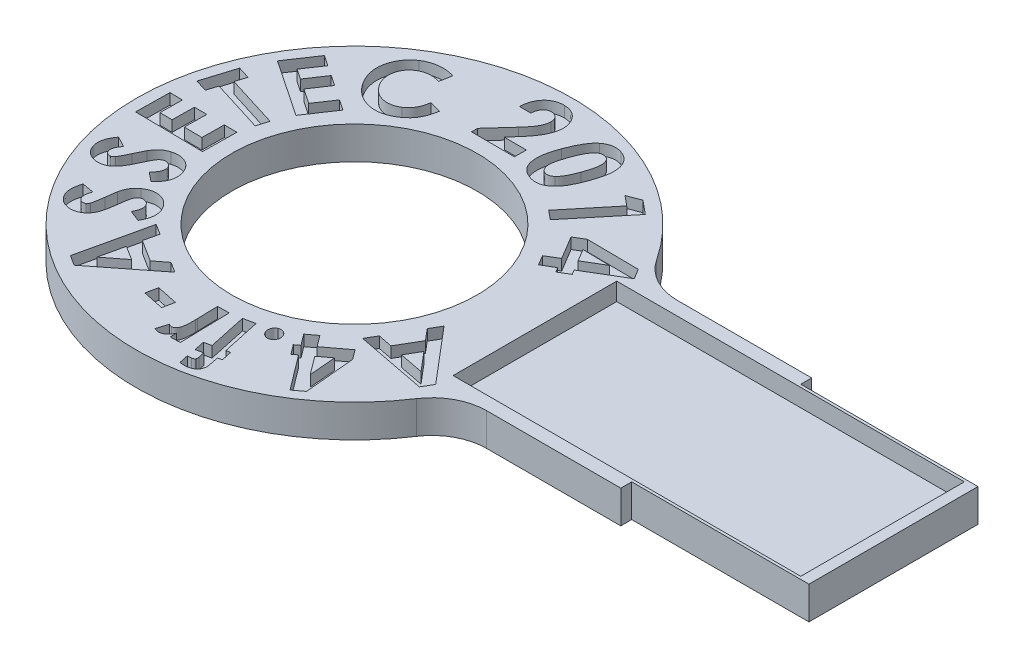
from build123d import *

# Parameters (mm, degrees)
BOSS_EXTRU_1_DEPTH      = 2.4
ESQUISSE2_W             = 25.5
ESQUISSE2_H             = 12
ENL_V_MAT_EXTRU_1_DEPTH = 1.3
ESQUISSE3_R             = 9
ENL_V_MAT_EXTRU_2_DEPTH = 35.559151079
ENL_V_MAT_EXTRU_3_DEPTH = 0.8
CONG_1_R                = 4


with BuildPart() as part:
    # Esquisse1 → Boss.-Extru.1 (new body)
    with BuildSketch(Plane(origin=(0, 0, 0), x_dir=(1, 0, 0), z_dir=(0, 1, 0))):
        with BuildLine():
            Line((25, 6.2), (25, -6.2))
            Line((25, -6.2), (12, -6.2))
            Line((12, -6.2), (12, -7))
            Line((12, -7), (-0.150595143, -7))
            ThreePointArc((-0.150595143, -7), (-30.538089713, 0), (-0.150595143, 7))
            Line((-0.150595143, 7), (12, 7))
            Line((12, 7), (12, 6.2))
            Line((12, 6.2), (25, 6.2))
        make_face()
    extrude(amount=-BOSS_EXTRU_1_DEPTH)

    # Esquisse2 → Enl_v. mat.-Extru.1 (cut)
    with BuildSketch(Plane(origin=(0, 0, 0), x_dir=(1, 0, 0), z_dir=(0, 1, 0))):
        with Locations((11.45, 0)):
            Rectangle(ESQUISSE2_W, ESQUISSE2_H)
    extrude(amount=-ENL_V_MAT_EXTRU_1_DEPTH, mode=Mode.SUBTRACT)

    # Esquisse3 → Enl_v. mat.-Extru.2 (cut, through all)
    with BuildSketch(Plane(origin=(0, 0, 0), x_dir=(1, 0, 0), z_dir=(0, 1, 0))):
        with Locations(Location((-14.538089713, 0, 0), (0, 0, 270))):
            Circle(ESQUISSE3_R)
    extrude(amount=-ENL_V_MAT_EXTRU_2_DEPTH, mode=Mode.SUBTRACT)

    # Esquisse4 → Enl_v. mat.-Extru.3 (cut)
    # profile 1 of 17: a face of its own
    with BuildSketch(Plane(origin=(0, 0, 0), x_dir=(1, 0, 0), z_dir=(0, 1, 0))):
        Polygon((-1.258038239, 7.539169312), (-0.812325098, 6.793977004), (-3.569736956, 5.143335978), (-3.360402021, 4.794778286), (-4.113607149, 4.344057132), (-4.322942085, 4.692614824), (-5.202349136, 4.165771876), (-5.638046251, 4.894938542), (-4.7586392, 5.421781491), (-5.781275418, 7.129513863), (-5.02807029, 7.580235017), align=None)
        Polygon((-4.005434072, 5.872502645), (-2.570137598, 6.731877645), (-4.541291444, 6.766933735), align=None, mode=Mode.SUBTRACT)
    # profile 2 of 17: a face of its own
    with BuildSketch(Plane(origin=(0, 0, 0), x_dir=(1, 0, 0), z_dir=(0, 1, 0))):
        Polygon((-5.48309813, 12.107136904), (-4.485501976, 11.283819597), (-7.634540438, 7.462705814), (-8.296599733, 8.008579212), (-5.710461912, 11.146600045), (-6.430614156, 11.740550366), align=None)
    # profile 3 of 17: a face of its own
    with BuildSketch(Plane(origin=(0, 0, 0), x_dir=(1, 0, 0), z_dir=(0, 1, 0))):
        with BuildLine():
            add(Edge.make_bspline(
                [(-9.332782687, 14.355199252), (-9.294450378, 14.340822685), (-9.219190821, 14.312596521), (-9.112270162, 14.259650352), (-9.012604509, 14.200468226), (-8.918044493, 14.136666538), (-8.832666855, 14.063982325), (-8.752490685, 13.986770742), (-8.680184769, 13.902166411), (-8.6151973, 13.810795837), (-8.556841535, 13.713543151), (-8.506375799, 13.609709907), (-8.46470415, 13.498865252), (-8.429160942, 13.381955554), (-8.403824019, 13.257773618), (-8.384548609, 13.127736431), (-8.37380702, 12.990884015), (-8.370760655, 12.846745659), (-8.376916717, 12.693876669), (-8.393348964, 12.531407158), (-8.419689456, 12.358246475), (-8.456768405, 12.174405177), (-8.505691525, 11.980331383), (-8.562587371, 11.775330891), (-8.63083112, 11.559881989), (-8.682947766, 11.413667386), (-8.709785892, 11.338372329)],
                knots=[0, 0, 0, 0, 0.84727759, 1.663498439, 2.46616903, 3.246621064, 4.022004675, 4.784648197, 5.54948188, 6.322581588, 7.103890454, 7.89540897, 8.709401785, 9.55365625, 10.422763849, 11.331021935, 12.274281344, 13.263080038, 14.314697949, 15.440078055, 16.642649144, 17.940132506, 19.321726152, 20.78602639, 22.34492369, 24, 24, 24, 24], degree=3))
            add(Edge.make_bspline(
                [(-8.709785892, 11.338372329), (-8.737760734, 11.26276494), (-8.792134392, 11.115809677), (-8.878073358, 10.904111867), (-8.966269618, 10.708332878), (-9.054243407, 10.526805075), (-9.144382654, 10.36086357), (-9.234711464, 10.208948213), (-9.32861573, 10.073715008), (-9.421667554, 9.951560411), (-9.516437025, 9.842901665), (-9.612128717, 9.744941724), (-9.709019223, 9.657274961), (-9.805918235, 9.578238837), (-9.904988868, 9.511248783), (-10.003676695, 9.452255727), (-10.104765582, 9.405537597), (-10.205782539, 9.366519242), (-10.309381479, 9.339646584), (-10.414921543, 9.321551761), (-10.522831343, 9.312412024), (-10.633140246, 9.313506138), (-10.745627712, 9.324976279), (-10.86071916, 9.345186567), (-10.978475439, 9.3738226), (-11.05606733, 9.400632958), (-11.095603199, 9.414293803)],
                knots=[0, 0, 0, 0, 1.676343, 3.258245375, 4.749863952, 6.140889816, 7.451855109, 8.675849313, 9.813977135, 10.873498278, 11.867533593, 12.810149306, 13.719423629, 14.583580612, 15.407769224, 16.204360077, 16.971482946, 17.720677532, 18.453216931, 19.192828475, 19.945232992, 20.702013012, 21.483330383, 22.29371864, 23.130588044, 24, 24, 24, 24], degree=3))
            add(Edge.make_bspline(
                [(-11.095603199, 9.414293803), (-11.134865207, 9.429500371), (-11.211732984, 9.45927203), (-11.321903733, 9.511497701), (-11.423585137, 9.570797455), (-11.518912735, 9.63458731), (-11.604703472, 9.706494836), (-11.684619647, 9.782318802), (-11.755834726, 9.865235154), (-11.820357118, 9.953342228), (-11.876629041, 10.048432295), (-11.925820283, 10.14950268), (-11.96663828, 10.257294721), (-12.000920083, 10.37105988), (-12.027588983, 10.491284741), (-12.047912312, 10.617669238), (-12.059360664, 10.750549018), (-12.064714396, 10.89062176), (-12.060814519, 11.039568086), (-12.044821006, 11.198649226), (-12.019912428, 11.368863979), (-11.983445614, 11.550297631), (-11.93584879, 11.742540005), (-11.878608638, 11.946364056), (-11.81060152, 12.161089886), (-11.75908361, 12.307064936), (-11.73262243, 12.382042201)],
                knots=[0, 0, 0, 0, 0.882603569, 1.727975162, 2.55281072, 3.348836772, 4.129479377, 4.89682755, 5.656087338, 6.41776336, 7.183673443, 7.969477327, 8.77157415, 9.59759695, 10.458589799, 11.351624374, 12.279426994, 13.253048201, 14.289417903, 15.400381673, 16.603170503, 17.894977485, 19.278648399, 20.754590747, 22.333058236, 24, 24, 24, 24], degree=3))
            add(Edge.make_bspline(
                [(-11.73262243, 12.382042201), (-11.694204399, 12.485929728), (-11.620092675, 12.686337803), (-11.497080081, 12.969977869), (-11.373089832, 13.22824521), (-11.243363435, 13.458779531), (-11.112976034, 13.664796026), (-10.977319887, 13.843298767), (-10.84045435, 13.998461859), (-10.739412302, 14.083194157), (-10.690955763, 14.12382906)],
                knots=[0, 0, 0, 0, 1.294628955, 2.497451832, 3.612884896, 4.642137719, 5.588386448, 6.46033535, 7.261626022, 8, 8, 8, 8], degree=3))
            add(Edge.make_bspline(
                [(-10.690955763, 14.12382906), (-10.638366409, 14.162157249), (-10.535752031, 14.236944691), (-10.371456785, 14.325321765), (-10.204353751, 14.390673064), (-10.034596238, 14.432075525), (-9.861623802, 14.449582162), (-9.686542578, 14.441705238), (-9.508288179, 14.412017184), (-9.392147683, 14.374418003), (-9.332782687, 14.355199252)],
                knots=[0, 0, 0, 0, 1.081055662, 2.109397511, 3.091882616, 4.057296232, 5.00575351, 5.97249102, 6.963642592, 8, 8, 8, 8], degree=3))
        make_face()
        with BuildLine():
            add(Edge.make_bspline(
                [(-9.620242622, 13.49882906), (-9.654343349, 13.509248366), (-9.722145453, 13.529964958), (-9.828947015, 13.536046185), (-9.936271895, 13.522858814), (-10.044262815, 13.487914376), (-10.153393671, 13.428253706), (-10.259368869, 13.336814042), (-10.367004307, 13.218750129), (-10.451761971, 13.097882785), (-10.522563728, 12.986706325), (-10.575700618, 12.887840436), (-10.63208329, 12.778950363), (-10.688920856, 12.658561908), (-10.74693849, 12.527277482), (-10.806130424, 12.384712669), (-10.866027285, 12.230683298), (-10.905156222, 12.123700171), (-10.925330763, 12.068540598)],
                knots=[0, 0, 0, 0, 0.798248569, 1.587148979, 2.380312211, 3.214839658, 4.120668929, 5.153473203, 6.342071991, 7.700712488, 8.461987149, 9.300813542, 10.219487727, 11.215420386, 12.289438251, 13.442200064, 14.681220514, 16, 16, 16, 16], degree=3))
            add(Edge.make_bspline(
                [(-10.925330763, 12.068540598), (-10.950509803, 11.996917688), (-10.998875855, 11.859338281), (-11.060837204, 11.659176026), (-11.111589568, 11.474253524), (-11.150290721, 11.304279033), (-11.175618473, 11.148700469), (-11.18927894, 11.008157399), (-11.191165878, 10.882383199), (-11.180266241, 10.77054204), (-11.158921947, 10.671336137), (-11.130135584, 10.582121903), (-11.092641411, 10.502864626), (-11.049720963, 10.43149964), (-10.998411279, 10.369558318), (-10.938307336, 10.318378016), (-10.871976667, 10.27510396), (-10.822896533, 10.255511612), (-10.798127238, 10.245623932)],
                knots=[0, 0, 0, 0, 1.807733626, 3.472449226, 4.98835781, 6.373267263, 7.621493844, 8.739327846, 9.73315046, 10.612048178, 11.408867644, 12.145507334, 12.839056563, 13.492194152, 14.124332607, 14.744356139, 15.366313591, 16, 16, 16, 16], degree=3))
            add(Edge.make_bspline(
                [(-10.798127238, 10.245623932), (-10.773603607, 10.237890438), (-10.725273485, 10.2226496), (-10.650509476, 10.21253661), (-10.575916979, 10.214968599), (-10.501437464, 10.227642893), (-10.427353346, 10.25393613), (-10.353298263, 10.289963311), (-10.279203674, 10.337596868), (-10.233122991, 10.376602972), (-10.20918493, 10.396865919)],
                knots=[0, 0, 0, 0, 0.961686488, 1.895250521, 2.808245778, 3.747568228, 4.712256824, 5.741081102, 6.826533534, 8, 8, 8, 8], degree=3))
            add(Edge.make_bspline(
                [(-10.20918493, 10.396865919), (-10.179186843, 10.425665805), (-10.116134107, 10.486200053), (-10.029445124, 10.594001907), (-9.943484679, 10.719976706), (-9.857751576, 10.864271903), (-9.772638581, 11.027150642), (-9.688783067, 11.208791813), (-9.605996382, 11.409217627), (-9.553379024, 11.549880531), (-9.526091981, 11.622827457)],
                knots=[0, 0, 0, 0, 0.704441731, 1.480660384, 2.339494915, 3.288891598, 4.324436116, 5.453924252, 6.679620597, 8, 8, 8, 8], degree=3))
            add(Edge.make_bspline(
                [(-9.526091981, 11.622827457), (-9.499523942, 11.69710055), (-9.448449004, 11.839884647), (-9.383396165, 12.048065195), (-9.331025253, 12.240545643), (-9.290637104, 12.416921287), (-9.261596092, 12.577260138), (-9.246450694, 12.72187799), (-9.241950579, 12.850990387), (-9.252418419, 12.965387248), (-9.271648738, 13.067247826), (-9.297960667, 13.158578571), (-9.333551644, 13.239769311), (-9.375798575, 13.311459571), (-9.424496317, 13.374779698), (-9.483057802, 13.425962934), (-9.547523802, 13.469586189), (-9.595771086, 13.488988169), (-9.620242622, 13.49882906)],
                knots=[0, 0, 0, 0, 1.835258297, 3.528137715, 5.073397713, 6.475495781, 7.737322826, 8.862019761, 9.856643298, 10.737898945, 11.52863283, 12.266013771, 12.944356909, 13.585188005, 14.19908532, 14.793250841, 15.387923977, 16, 16, 16, 16], degree=3))
        make_face(mode=Mode.SUBTRACT)
    # profile 4 of 17: a face of its own
    with BuildSketch(Plane(origin=(0, 0, 0), x_dir=(1, 0, 0), z_dir=(0, 1, 0))):
        with BuildLine():
            Line((-15.118708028, 13.52238305), (-15.964060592, 13.527391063))
            add(Edge.make_bspline(
                [(-15.964060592, 13.527391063), (-15.959642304, 13.592586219), (-15.950998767, 13.720128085), (-15.922822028, 13.90530753), (-15.882753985, 14.079795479), (-15.830899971, 14.243924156), (-15.76601227, 14.397300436), (-15.688163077, 14.539667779), (-15.598985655, 14.671471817), (-15.497579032, 14.791962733), (-15.385996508, 14.899551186), (-15.266315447, 14.993466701), (-15.1389415, 15.072296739), (-15.003903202, 15.136641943), (-14.861280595, 15.187059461), (-14.711054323, 15.221562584), (-14.553798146, 15.243627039), (-14.446375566, 15.245291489), (-14.391544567, 15.246141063)],
                knots=[0, 0, 0, 0, 1.203128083, 2.353690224, 3.445571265, 4.497663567, 5.519878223, 6.507781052, 7.481651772, 8.446139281, 9.402891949, 10.331607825, 11.242855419, 12.156009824, 13.081748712, 14.022921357, 14.990852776, 16, 16, 16, 16], degree=3))
            add(Edge.make_bspline(
                [(-14.391544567, 15.246141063), (-14.324244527, 15.243656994), (-14.192595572, 15.238797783), (-14.001761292, 15.200217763), (-13.822353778, 15.140934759), (-13.65726795, 15.054486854), (-13.506287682, 14.946926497), (-13.370365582, 14.817892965), (-13.250486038, 14.66770503), (-13.150598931, 14.498177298), (-13.067413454, 14.319714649), (-13.009529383, 14.135773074), (-12.97211905, 13.950925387), (-12.968212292, 13.82671206), (-12.966264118, 13.764770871)],
                knots=[0, 0, 0, 0, 1.057684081, 2.068988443, 3.050389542, 4.020373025, 4.987908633, 5.957380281, 6.958710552, 7.999761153, 9.04538399, 10.048447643, 11.026823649, 12, 12, 12, 12], degree=3))
            add(Edge.make_bspline(
                [(-12.966264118, 13.764770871), (-12.967130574, 13.727354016), (-12.968874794, 13.65203195), (-12.98020047, 13.53790344), (-12.999512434, 13.421950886), (-13.025598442, 13.303596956), (-13.058882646, 13.183313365), (-13.098796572, 13.06077913), (-13.147356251, 12.936731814), (-13.202676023, 12.809536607), (-13.267284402, 12.678219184), (-13.343349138, 12.541843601), (-13.433399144, 12.401083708), (-13.533500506, 12.253471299), (-13.645994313, 12.10031727), (-13.770429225, 11.941155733), (-13.906317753, 11.775836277), (-14.003256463, 11.66579334), (-14.0530029, 11.609322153)],
                knots=[0, 0, 0, 0, 0.728041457, 1.465585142, 2.229189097, 3.014131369, 3.822618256, 4.656669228, 5.520447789, 6.413555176, 7.354858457, 8.366936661, 9.450113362, 10.605072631, 11.836840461, 13.146712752, 14.53576682, 16, 16, 16, 16], degree=3))
            Line((-14.0530029, 11.609322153), (-14.566825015, 11.024386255))
            Line((-14.566825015, 11.024386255), (-12.943227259, 11.015371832))
            Line((-12.943227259, 11.015371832), (-12.948235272, 10.139971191))
            Line((-12.948235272, 10.139971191), (-16.106288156, 10.156998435))
            Line((-16.106288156, 10.156998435), (-16.104284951, 10.609722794))
            Line((-16.104284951, 10.609722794), (-14.685014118, 12.171221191))
            add(Edge.make_bspline(
                [(-14.685014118, 12.171221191), (-14.643759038, 12.216791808), (-14.564054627, 12.304833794), (-14.451757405, 12.435011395), (-14.350646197, 12.558561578), (-14.258995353, 12.673928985), (-14.179795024, 12.784210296), (-14.109604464, 12.886078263), (-14.050849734, 12.982095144), (-13.988159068, 13.098358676), (-13.926195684, 13.236276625), (-13.871234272, 13.39561077), (-13.836823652, 13.547629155), (-13.83198414, 13.646756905), (-13.829645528, 13.694658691)],
                knots=[0, 0, 0, 0, 1.240062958, 2.395789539, 3.467738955, 4.460755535, 5.367447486, 6.206228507, 6.955906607, 7.636971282, 8.869990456, 10.000978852, 11.034007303, 12, 12, 12, 12], degree=3))
            add(Edge.make_bspline(
                [(-13.829645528, 13.694658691), (-13.8312659, 13.740604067), (-13.83440834, 13.829707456), (-13.867530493, 13.95729162), (-13.922061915, 14.072642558), (-13.998585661, 14.17283822), (-14.091850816, 14.255176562), (-14.199128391, 14.3177464), (-14.321332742, 14.352771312), (-14.406690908, 14.358021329), (-14.450639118, 14.360724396)],
                knots=[0, 0, 0, 0, 1.079651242, 2.093803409, 3.078157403, 4.065362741, 5.039877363, 5.990388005, 6.965314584, 8, 8, 8, 8], degree=3))
            add(Edge.make_bspline(
                [(-14.450639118, 14.360724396), (-14.473393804, 14.360330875), (-14.518516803, 14.359550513), (-14.584231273, 14.347808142), (-14.647420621, 14.330807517), (-14.707932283, 14.306900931), (-14.765186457, 14.274407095), (-14.819204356, 14.235005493), (-14.87114035, 14.189643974), (-14.935289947, 14.118074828), (-15.005051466, 14.013166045), (-15.065854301, 13.867326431), (-15.106676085, 13.701750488), (-15.11457024, 13.584067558), (-15.118708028, 13.52238305)],
                knots=[0, 0, 0, 0, 0.685577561, 1.359514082, 2.007041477, 2.657928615, 3.316331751, 3.987250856, 4.672310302, 5.392527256, 6.881480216, 8.447379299, 10.137863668, 12, 12, 12, 12], degree=3))
        make_face()
    # profile 5 of 17: a face of its own
    with BuildSketch(Plane(origin=(0, 0, 0), x_dir=(1, 0, 0), z_dir=(0, 1, 0))):
        with BuildLine():
            Line((-20.352639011, 13.028094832), (-20.517903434, 12.166716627))
            add(Edge.make_bspline(
                [(-20.517903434, 12.166716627), (-20.592070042, 12.185710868), (-20.736251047, 12.222635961), (-20.95223781, 12.255153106), (-21.159910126, 12.264997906), (-21.360129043, 12.255977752), (-21.552061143, 12.223707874), (-21.736085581, 12.170398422), (-21.91174587, 12.095211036), (-22.020675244, 12.029469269), (-22.075395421, 11.996444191)],
                knots=[0, 0, 0, 0, 1.135382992, 2.207201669, 3.233756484, 4.215784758, 5.175075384, 6.114046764, 7.052599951, 8, 8, 8, 8], degree=3))
            add(Edge.make_bspline(
                [(-22.075395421, 11.996444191), (-22.119483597, 11.965958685), (-22.20620464, 11.90599397), (-22.323135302, 11.801499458), (-22.426357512, 11.688295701), (-22.516810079, 11.566215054), (-22.591755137, 11.434001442), (-22.654342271, 11.293258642), (-22.702444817, 11.143116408), (-22.735749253, 10.985668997), (-22.756051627, 10.82517782), (-22.760250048, 10.664432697), (-22.747846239, 10.505473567), (-22.720922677, 10.348152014), (-22.678446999, 10.192465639), (-22.619967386, 10.038941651), (-22.545784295, 9.887065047), (-22.485580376, 9.790089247), (-22.455002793, 9.740835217)],
                knots=[0, 0, 0, 0, 1.008211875, 1.983143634, 2.944058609, 3.888054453, 4.836724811, 5.798995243, 6.782799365, 7.798505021, 8.824348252, 9.823924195, 10.819759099, 11.820934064, 12.824118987, 13.852442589, 14.909255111, 16, 16, 16, 16], degree=3))
            add(Edge.make_bspline(
                [(-22.455002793, 9.740835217), (-22.409056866, 9.674932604), (-22.319286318, 9.546170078), (-22.162405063, 9.37564227), (-21.992428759, 9.230517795), (-21.810677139, 9.110467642), (-21.61910867, 9.017690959), (-21.420057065, 8.954216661), (-21.215165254, 8.918250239), (-21.006495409, 8.913105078), (-20.7977017, 8.934382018), (-20.594009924, 8.986522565), (-20.396005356, 9.065605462), (-20.273591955, 9.139432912), (-20.211413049, 9.176932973)],
                knots=[0, 0, 0, 0, 1.115455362, 2.17941057, 3.209555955, 4.214580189, 5.198203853, 6.157822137, 7.109002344, 8.079095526, 9.049532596, 10.016157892, 10.992323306, 12, 12, 12, 12], degree=3))
            add(Edge.make_bspline(
                [(-20.211413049, 9.176932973), (-20.160849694, 9.212258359), (-20.061039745, 9.281989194), (-19.927582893, 9.403521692), (-19.812420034, 9.537543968), (-19.728945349, 9.658377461), (-19.672144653, 9.764149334), (-19.630559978, 9.850397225), (-19.59331067, 9.944820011), (-19.556431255, 10.045928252), (-19.525252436, 10.155703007), (-19.494959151, 10.272466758), (-19.468092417, 10.397195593), (-19.452304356, 10.482979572), (-19.444185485, 10.527093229)],
                knots=[0, 0, 0, 0, 1.382451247, 2.728900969, 4.034972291, 5.339325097, 6.012862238, 6.726303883, 7.485552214, 8.28848567, 9.139165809, 10.043648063, 10.993963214, 12, 12, 12, 12], degree=3))
            Line((-19.444185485, 10.527093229), (-18.585812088, 10.292718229))
            add(Edge.make_bspline(
                [(-18.585812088, 10.292718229), (-18.59721052, 10.233900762), (-18.619487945, 10.118946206), (-18.656919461, 9.951589), (-18.700341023, 9.794032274), (-18.747156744, 9.645920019), (-18.797723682, 9.507138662), (-18.854530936, 9.378997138), (-18.913009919, 9.25893137), (-18.977771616, 9.148127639), (-19.047838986, 9.043542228), (-19.124204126, 8.943303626), (-19.207122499, 8.845980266), (-19.297866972, 8.753138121), (-19.394119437, 8.662108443), (-19.498541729, 8.575810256), (-19.608393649, 8.490848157), (-19.686246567, 8.438961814), (-19.725635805, 8.412710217)],
                knots=[0, 0, 0, 0, 1.264995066, 2.47234286, 3.619864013, 4.71452534, 5.751654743, 6.7365591, 7.672887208, 8.570022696, 9.443981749, 10.329408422, 11.229364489, 12.141687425, 13.069324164, 14.025165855, 15.000843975, 16, 16, 16, 16], degree=3))
            add(Edge.make_bspline(
                [(-19.725635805, 8.412710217), (-19.79956964, 8.366772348), (-19.944468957, 8.27674096), (-20.172618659, 8.170039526), (-20.401764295, 8.086057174), (-20.634884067, 8.031153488), (-20.86984386, 8.001016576), (-21.107349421, 7.995314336), (-21.346962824, 8.018578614), (-21.586871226, 8.065261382), (-21.822888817, 8.13610308), (-22.049960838, 8.230677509), (-22.266861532, 8.347582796), (-22.472620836, 8.487519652), (-22.66772971, 8.649626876), (-22.851575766, 8.834445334), (-23.025758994, 9.04080735), (-23.129358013, 9.192007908), (-23.182166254, 9.269080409)],
                knots=[0, 0, 0, 0, 1.045004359, 2.048053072, 3.020002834, 3.972537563, 4.91888622, 5.861776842, 6.82055843, 7.805516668, 8.794119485, 9.775985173, 10.755956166, 11.749502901, 12.760795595, 13.798948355, 14.878042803, 16, 16, 16, 16], degree=3))
            add(Edge.make_bspline(
                [(-23.182166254, 9.269080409), (-23.214923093, 9.320412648), (-23.279512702, 9.421629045), (-23.363083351, 9.578928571), (-23.43778371, 9.73602114), (-23.501110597, 9.894578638), (-23.552964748, 10.054320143), (-23.595905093, 10.214562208), (-23.625326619, 10.376458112), (-23.645694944, 10.53860455), (-23.655049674, 10.700596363), (-23.6515157, 10.861557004), (-23.63844834, 11.021087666), (-23.615976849, 11.179932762), (-23.580236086, 11.336955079), (-23.535249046, 11.492990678), (-23.479047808, 11.647261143), (-23.412056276, 11.799129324), (-23.335223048, 11.946538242), (-23.250299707, 12.087970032), (-23.156880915, 12.22145419), (-23.055613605, 12.347395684), (-22.944772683, 12.464545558), (-22.82662752, 12.574923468), (-22.699950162, 12.677972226), (-22.609707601, 12.739593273), (-22.564177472, 12.770682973)],
                knots=[0, 0, 0, 0, 1.10493832, 2.178706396, 3.230582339, 4.261437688, 5.275264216, 6.277779, 7.270297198, 8.259535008, 9.242833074, 10.212666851, 11.179485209, 12.147119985, 13.12195873, 14.100107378, 15.093198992, 16.099899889, 17.110969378, 18.108746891, 19.092287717, 20.066221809, 21.039457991, 22.017118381, 22.999575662, 24, 24, 24, 24], degree=3))
            add(Edge.make_bspline(
                [(-22.564177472, 12.770682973), (-22.524417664, 12.795901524), (-22.445291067, 12.846089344), (-22.321642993, 12.911991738), (-22.19483533, 12.970384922), (-22.064644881, 13.021258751), (-21.931397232, 13.065601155), (-21.794606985, 13.101875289), (-21.65432918, 13.129420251), (-21.511323, 13.150862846), (-21.366808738, 13.163192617), (-21.221753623, 13.170043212), (-21.076596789, 13.166548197), (-20.931498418, 13.1556025), (-20.786259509, 13.136748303), (-20.641752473, 13.108057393), (-20.496288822, 13.073681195), (-20.400876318, 13.043402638), (-20.352639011, 13.028094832)],
                knots=[0, 0, 0, 0, 0.980828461, 1.951961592, 2.916970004, 3.888501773, 4.863117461, 5.841871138, 6.835154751, 7.840691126, 8.853517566, 9.856209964, 10.865206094, 11.876884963, 12.887391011, 13.914807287, 14.945797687, 16, 16, 16, 16], degree=3))
        make_face()
    # profile 6 of 17: a face of its own
    with BuildSketch(Plane(origin=(0, 0, 0), x_dir=(1, 0, 0), z_dir=(0, 1, 0))):
        Polygon((-27.735720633, 7.54853447), (-26.350504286, 9.609832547), (-25.579270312, 9.091002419), (-26.485720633, 7.742845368), (-25.735520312, 7.239039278), (-24.829069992, 8.587196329), (-24.071858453, 8.078382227), (-24.978308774, 6.730225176), (-23.887563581, 5.997052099), (-22.981113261, 7.34520915), (-22.206874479, 6.825377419), (-23.592090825, 4.764079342), align=None)
    # profile 7 of 17: a face of its own
    with BuildSketch(Plane(origin=(0, 0, 0), x_dir=(1, 0, 0), z_dir=(0, 1, 0))):
        Polygon((-29.407021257, 3.312034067), (-28.661828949, 5.70386099), (-27.77140427, 5.42641708), (-28.016796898, 4.638155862), (-24.164633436, 3.43823599), (-24.425050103, 2.601897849), (-28.277213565, 3.801817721), (-28.516596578, 3.034590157), align=None)
    # profile 8 of 17: a face of its own
    with BuildSketch(Plane(origin=(0, 0, 0), x_dir=(1, 0, 0), z_dir=(0, 1, 0))):
        Polygon((-29.695859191, -0.895918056), (-29.660803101, 1.592062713), (-28.734320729, 1.57904188), (-28.757357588, -0.047560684), (-27.857918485, -0.059579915), (-27.834881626, 1.567022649), (-26.925426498, 1.554001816), (-26.948463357, -0.072600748), (-25.640370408, -0.090629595), (-25.617333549, 1.535972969), (-24.68784637, 1.522952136), (-24.72290246, -0.965028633), align=None)
    # profile 9 of 17: a face of its own
    with BuildSketch(Plane(origin=(0, 0, 0), x_dir=(1, 0, 0), z_dir=(0, 1, 0))):
        with BuildLine():
            Line((-28.719134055, -3.116911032), (-27.938885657, -3.540588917))
            add(Edge.make_bspline(
                [(-27.938885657, -3.540588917), (-27.969203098, -3.57887613), (-28.027355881, -3.652315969), (-28.10128609, -3.764747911), (-28.161784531, -3.871927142), (-28.204978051, -3.975581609), (-28.234523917, -4.074553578), (-28.246504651, -4.169839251), (-28.244844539, -4.261207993), (-28.230422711, -4.318664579), (-28.223340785, -4.346878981)],
                knots=[0, 0, 0, 0, 1.317388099, 2.526921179, 3.627877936, 4.633568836, 5.551914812, 6.405758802, 7.217138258, 8, 8, 8, 8], degree=3))
            add(Edge.make_bspline(
                [(-28.223340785, -4.346878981), (-28.214199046, -4.372318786), (-28.196575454, -4.421362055), (-28.156387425, -4.486825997), (-28.107226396, -4.542329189), (-28.047669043, -4.583207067), (-27.985433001, -4.614376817), (-27.921376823, -4.628547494), (-27.85837084, -4.633752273), (-27.818576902, -4.62346282), (-27.798661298, -4.618313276)],
                knots=[0, 0, 0, 0, 1.158379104, 2.233142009, 3.278809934, 4.317373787, 5.318019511, 6.246717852, 7.122537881, 8, 8, 8, 8], degree=3))
            add(Edge.make_bspline(
                [(-27.798661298, -4.618313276), (-27.779332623, -4.611273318), (-27.740535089, -4.597142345), (-27.687519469, -4.564219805), (-27.638207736, -4.523754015), (-27.610536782, -4.490927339), (-27.59633758, -4.474082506)],
                knots=[0, 0, 0, 0, 0.976748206, 1.960580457, 2.953482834, 4, 4, 4, 4], degree=3))
            add(Edge.make_bspline(
                [(-27.59633758, -4.474082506), (-27.585744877, -4.459551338), (-27.56138156, -4.426129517), (-27.526548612, -4.365081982), (-27.483024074, -4.289917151), (-27.432906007, -4.199100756), (-27.378397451, -4.091266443), (-27.31599602, -3.968384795), (-27.248295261, -3.829284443), (-27.201317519, -3.731253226), (-27.176666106, -3.679811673)],
                knots=[0, 0, 0, 0, 0.479644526, 1.103186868, 1.873596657, 2.798880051, 3.870990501, 5.098467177, 6.477430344, 8, 8, 8, 8], degree=3))
            add(Edge.make_bspline(
                [(-27.176666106, -3.679811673), (-27.153999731, -3.63171751), (-27.110833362, -3.540125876), (-27.049086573, -3.410573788), (-26.993612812, -3.295749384), (-26.945056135, -3.195656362), (-26.901348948, -3.110676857), (-26.866285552, -3.039535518), (-26.835719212, -2.984216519), (-26.817772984, -2.952305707), (-26.810079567, -2.938625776)],
                knots=[0, 0, 0, 0, 1.542854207, 2.93824713, 4.164542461, 5.243436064, 6.166325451, 6.937570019, 7.544544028, 8, 8, 8, 8], degree=3))
            add(Edge.make_bspline(
                [(-26.810079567, -2.938625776), (-26.777585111, -2.884947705), (-26.714919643, -2.781429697), (-26.61033142, -2.641874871), (-26.505232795, -2.519544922), (-26.394343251, -2.416850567), (-26.276557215, -2.329039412), (-26.150978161, -2.253129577), (-26.014838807, -2.189106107), (-25.919328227, -2.156162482), (-25.870576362, -2.139346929)],
                knots=[0, 0, 0, 0, 1.189295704, 2.293553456, 3.303154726, 4.244044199, 5.15327527, 6.084958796, 7.022497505, 8, 8, 8, 8], degree=3))
            add(Edge.make_bspline(
                [(-25.870576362, -2.139346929), (-25.822728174, -2.125371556), (-25.728636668, -2.097889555), (-25.586211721, -2.073733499), (-25.446843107, -2.060720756), (-25.309928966, -2.063123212), (-25.175718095, -2.077898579), (-25.04409075, -2.106180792), (-24.915430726, -2.148323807), (-24.791147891, -2.204748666), (-24.671981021, -2.270881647), (-24.562047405, -2.349828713), (-24.46174592, -2.439172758), (-24.370398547, -2.53904495), (-24.290896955, -2.650635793), (-24.219982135, -2.772229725), (-24.158661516, -2.904305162), (-24.126922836, -2.998056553), (-24.110760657, -3.04579725)],
                knots=[0, 0, 0, 0, 1.076334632, 2.11656805, 3.115943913, 4.097239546, 5.070038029, 6.02944806, 7.001363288, 7.989556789, 8.974822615, 9.94182515, 10.907642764, 11.872921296, 12.86006078, 13.862349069, 14.911451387, 16, 16, 16, 16], degree=3))
            add(Edge.make_bspline(
                [(-24.110760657, -3.04579725), (-24.099388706, -3.084021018), (-24.077049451, -3.159108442), (-24.055759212, -3.273271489), (-24.041116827, -3.385605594), (-24.036167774, -3.496836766), (-24.040116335, -3.606714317), (-24.053207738, -3.715260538), (-24.075319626, -3.822804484), (-24.106642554, -3.9292486), (-24.146543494, -4.035049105), (-24.197890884, -4.139439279), (-24.255841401, -4.245038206), (-24.327728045, -4.347950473), (-24.406092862, -4.452517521), (-24.496113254, -4.555593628), (-24.595193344, -4.659094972), (-24.666957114, -4.725520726), (-24.703709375, -4.759539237)],
                knots=[0, 0, 0, 0, 0.990463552, 1.945683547, 2.882233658, 3.804188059, 4.709222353, 5.611819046, 6.518221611, 7.434595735, 8.366909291, 9.32439698, 10.323752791, 11.357080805, 12.440752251, 13.570246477, 14.755654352, 16, 16, 16, 16], degree=3))
            Line((-24.703709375, -4.759539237), (-25.377787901, -4.211662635))
            add(Edge.make_bspline(
                [(-25.377787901, -4.211662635), (-25.336330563, -4.170609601), (-25.256947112, -4.092000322), (-25.154811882, -3.968852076), (-25.072323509, -3.849119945), (-25.010245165, -3.732819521), (-24.968354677, -3.618961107), (-24.949271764, -3.507760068), (-24.948750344, -3.399041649), (-24.965701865, -3.330383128), (-24.974142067, -3.296197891)],
                knots=[0, 0, 0, 0, 1.329346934, 2.545463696, 3.641033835, 4.638499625, 5.543628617, 6.393201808, 7.19997144, 8, 8, 8, 8], degree=3))
            add(Edge.make_bspline(
                [(-24.974142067, -3.296197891), (-24.986259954, -3.262581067), (-25.009806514, -3.197259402), (-25.065283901, -3.110203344), (-25.135640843, -3.037783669), (-25.218693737, -2.981614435), (-25.307421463, -2.940699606), (-25.39869341, -2.917394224), (-25.490812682, -2.914439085), (-25.549593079, -2.929206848), (-25.579110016, -2.93662257)],
                knots=[0, 0, 0, 0, 1.09714073, 2.131880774, 3.149178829, 4.183765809, 5.199973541, 6.141992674, 7.066990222, 8, 8, 8, 8], degree=3))
            add(Edge.make_bspline(
                [(-25.579110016, -2.93662257), (-25.605527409, -2.946481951), (-25.659082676, -2.966469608), (-25.733991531, -3.012637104), (-25.80352988, -3.073331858), (-25.858874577, -3.133923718), (-25.901638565, -3.193333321), (-25.938159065, -3.24785201), (-25.976627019, -3.312534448), (-26.017557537, -3.387451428), (-26.062913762, -3.471102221), (-26.109810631, -3.565392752), (-26.158567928, -3.670037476), (-26.192431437, -3.742909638), (-26.210119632, -3.780973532)],
                knots=[0, 0, 0, 0, 0.934782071, 1.895058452, 2.901649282, 3.992804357, 4.611526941, 5.331109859, 6.171574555, 7.109573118, 8.166155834, 9.331406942, 10.60609263, 12, 12, 12, 12], degree=3))
            add(Edge.make_bspline(
                [(-26.210119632, -3.780973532), (-26.243107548, -3.853610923), (-26.306536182, -3.993276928), (-26.40411273, -4.191126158), (-26.496036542, -4.371083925), (-26.584086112, -4.53247011), (-26.667906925, -4.676012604), (-26.747845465, -4.800897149), (-26.822215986, -4.908415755), (-26.917697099, -5.02268465), (-27.036416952, -5.144021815), (-27.18976643, -5.261837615), (-27.34899606, -5.358418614), (-27.463629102, -5.399376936), (-27.520215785, -5.419595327)],
                knots=[0, 0, 0, 0, 1.328067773, 2.55358729, 3.67224788, 4.692090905, 5.613918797, 6.43882008, 7.160568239, 7.788265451, 8.916277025, 9.978048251, 11.001897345, 12, 12, 12, 12], degree=3))
            add(Edge.make_bspline(
                [(-27.520215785, -5.419595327), (-27.560775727, -5.430984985), (-27.641145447, -5.453553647), (-27.763189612, -5.474666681), (-27.884709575, -5.482748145), (-28.004749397, -5.478427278), (-28.124343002, -5.46377679), (-28.242408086, -5.435408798), (-28.359595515, -5.394690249), (-28.47433754, -5.343304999), (-28.584250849, -5.281663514), (-28.685548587, -5.210476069), (-28.777766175, -5.130811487), (-28.859507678, -5.042188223), (-28.934118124, -4.946578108), (-28.996646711, -4.840868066), (-29.050345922, -4.727130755), (-29.077793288, -4.646988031), (-29.091730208, -4.606294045)],
                knots=[0, 0, 0, 0, 1.026128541, 2.033278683, 3.011727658, 3.988551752, 4.956287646, 5.942955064, 6.94122681, 7.975450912, 9.002739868, 10.00715895, 10.987567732, 11.966151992, 12.940873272, 13.937087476, 14.952517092, 16, 16, 16, 16], degree=3))
            add(Edge.make_bspline(
                [(-29.091730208, -4.606294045), (-29.106612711, -4.552191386), (-29.136213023, -4.44458478), (-29.153455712, -4.277138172), (-29.148982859, -4.107660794), (-29.128461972, -3.964619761), (-29.099309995, -3.847809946), (-29.068675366, -3.75531147), (-29.030932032, -3.658507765), (-28.983944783, -3.557950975), (-28.930570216, -3.452743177), (-28.866202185, -3.34489975), (-28.79677787, -3.231355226), (-28.745495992, -3.15576758), (-28.719134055, -3.116911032)],
                knots=[0, 0, 0, 0, 1.264261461, 2.514532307, 3.780386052, 5.082172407, 5.765451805, 6.494375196, 7.279115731, 8.108261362, 8.997663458, 9.939493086, 10.940776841, 12, 12, 12, 12], degree=3))
        make_face()
    # profile 10 of 17: a face of its own
    with BuildSketch(Plane(origin=(0, 0, 0), x_dir=(1, 0, 0), z_dir=(0, 1, 0))):
        with BuildLine():
            Line((-27.046482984, -7.396317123), (-26.171082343, -7.554570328))
            add(Edge.make_bspline(
                [(-26.171082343, -7.554570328), (-26.188065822, -7.600427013), (-26.220581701, -7.688222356), (-26.257489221, -7.817962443), (-26.279206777, -7.939165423), (-26.290529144, -8.051096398), (-26.287257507, -8.154457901), (-26.26840845, -8.248561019), (-26.240066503, -8.335560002), (-26.207906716, -8.385444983), (-26.192115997, -8.409938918)],
                knots=[0, 0, 0, 0, 1.318249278, 2.523866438, 3.630954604, 4.634212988, 5.553113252, 6.405827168, 7.21724809, 8, 8, 8, 8], degree=3))
            add(Edge.make_bspline(
                [(-26.192115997, -8.409938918), (-26.175536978, -8.431368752), (-26.143533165, -8.472736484), (-26.083986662, -8.521263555), (-26.019755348, -8.557515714), (-25.951156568, -8.579199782), (-25.882077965, -8.587340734), (-25.816801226, -8.582546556), (-25.755770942, -8.565651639), (-25.72093965, -8.544053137), (-25.703333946, -8.533136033)],
                knots=[0, 0, 0, 0, 1.161042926, 2.24125459, 3.275312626, 4.314434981, 5.311084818, 6.246465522, 7.11366454, 8, 8, 8, 8], degree=3))
            add(Edge.make_bspline(
                [(-25.703333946, -8.533136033), (-25.687264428, -8.520199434), (-25.655150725, -8.494346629), (-25.613597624, -8.447861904), (-25.579969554, -8.393851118), (-25.564177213, -8.354134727), (-25.556098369, -8.333817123)],
                knots=[0, 0, 0, 0, 0.982905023, 1.964260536, 2.958582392, 4, 4, 4, 4], degree=3))
            add(Edge.make_bspline(
                [(-25.556098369, -8.333817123), (-25.550464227, -8.31686978), (-25.537363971, -8.277464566), (-25.523159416, -8.208309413), (-25.503931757, -8.122892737), (-25.487308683, -8.019972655), (-25.466659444, -7.900618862), (-25.445614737, -7.764426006), (-25.425201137, -7.610996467), (-25.410558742, -7.50315098), (-25.402853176, -7.446397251)],
                knots=[0, 0, 0, 0, 0.475123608, 1.104736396, 1.877054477, 2.80649406, 3.879117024, 5.102344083, 6.475107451, 8, 8, 8, 8], degree=3))
            add(Edge.make_bspline(
                [(-25.402853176, -7.446397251), (-25.39627557, -7.393633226), (-25.383780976, -7.293404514), (-25.364501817, -7.151252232), (-25.347449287, -7.025054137), (-25.33272471, -6.914788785), (-25.318745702, -6.820286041), (-25.305742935, -6.741873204), (-25.294891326, -6.679401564), (-25.287723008, -6.643435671), (-25.284664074, -6.628087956)],
                knots=[0, 0, 0, 0, 1.543176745, 2.931365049, 4.163319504, 5.239042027, 6.159912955, 6.935688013, 7.545826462, 8, 8, 8, 8], degree=3))
            add(Edge.make_bspline(
                [(-25.284664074, -6.628087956), (-25.270259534, -6.567063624), (-25.242509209, -6.449500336), (-25.187177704, -6.284129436), (-25.124215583, -6.135360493), (-25.051653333, -6.002041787), (-24.966528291, -5.881728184), (-24.870023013, -5.770650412), (-24.761529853, -5.665887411), (-24.680077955, -5.605255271), (-24.63863042, -5.574402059)],
                knots=[0, 0, 0, 0, 1.186290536, 2.285386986, 3.296050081, 4.240683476, 5.152359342, 6.079756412, 7.022866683, 8, 8, 8, 8], degree=3))
            add(Edge.make_bspline(
                [(-24.63863042, -5.574402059), (-24.597351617, -5.546300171), (-24.516164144, -5.491029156), (-24.388462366, -5.421819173), (-24.259058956, -5.366339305), (-24.128094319, -5.325238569), (-23.996076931, -5.296560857), (-23.862072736, -5.282492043), (-23.726541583, -5.282964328), (-23.590562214, -5.295467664), (-23.457170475, -5.322804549), (-23.327666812, -5.361699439), (-23.204012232, -5.414615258), (-23.087556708, -5.483173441), (-22.975269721, -5.561758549), (-22.871237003, -5.656559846), (-22.771214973, -5.762449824), (-22.71180488, -5.841546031), (-22.68149901, -5.881894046)],
                knots=[0, 0, 0, 0, 1.077391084, 2.119021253, 3.129674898, 4.112053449, 5.077472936, 6.041277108, 7.014199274, 7.998795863, 8.98391982, 9.948262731, 10.913493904, 11.878913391, 12.860789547, 13.866265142, 14.911553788, 16, 16, 16, 16], degree=3))
            add(Edge.make_bspline(
                [(-22.68149901, -5.881894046), (-22.658976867, -5.914634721), (-22.614666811, -5.979048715), (-22.557394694, -6.079853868), (-22.509001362, -6.182257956), (-22.470015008, -6.286500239), (-22.439494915, -6.39227698), (-22.418906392, -6.499934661), (-22.405094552, -6.609006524), (-22.40298553, -6.719944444), (-22.407390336, -6.832839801), (-22.422836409, -6.94840104), (-22.44809833, -7.066463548), (-22.482784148, -7.187383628), (-22.525399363, -7.311455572), (-22.579118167, -7.437509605), (-22.641376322, -7.566684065), (-22.689050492, -7.651968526), (-22.713550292, -7.69579629)],
                knots=[0, 0, 0, 0, 0.986442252, 1.940726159, 2.875323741, 3.796177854, 4.701525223, 5.605543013, 6.515623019, 7.427928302, 8.357400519, 9.318895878, 10.318901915, 11.352936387, 12.441028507, 13.574296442, 14.753428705, 16, 16, 16, 16], degree=3))
            Line((-22.713550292, -7.69579629), (-23.524848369, -7.3873027))
            add(Edge.make_bspline(
                [(-23.524848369, -7.3873027), (-23.498344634, -7.334926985), (-23.447815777, -7.235073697), (-23.388021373, -7.086557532), (-23.347109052, -6.947352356), (-23.323890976, -6.817348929), (-23.319969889, -6.69594991), (-23.336061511, -6.584201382), (-23.369626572, -6.481178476), (-23.407050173, -6.421455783), (-23.425689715, -6.391709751)],
                knots=[0, 0, 0, 0, 1.337549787, 2.550012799, 3.643407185, 4.639260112, 5.552735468, 6.398635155, 7.20240955, 8, 8, 8, 8], degree=3))
            add(Edge.make_bspline(
                [(-23.425689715, -6.391709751), (-23.447764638, -6.363779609), (-23.4907716, -6.309365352), (-23.570578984, -6.243822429), (-23.660484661, -6.197146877), (-23.756778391, -6.168807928), (-23.854241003, -6.15706958), (-23.947841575, -6.165180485), (-24.036134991, -6.190833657), (-24.087046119, -6.223133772), (-24.112789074, -6.239466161)],
                knots=[0, 0, 0, 0, 1.093282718, 2.129962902, 3.150219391, 4.190457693, 5.203705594, 6.152548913, 7.065845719, 8, 8, 8, 8], degree=3))
            add(Edge.make_bspline(
                [(-24.112789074, -6.239466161), (-24.135226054, -6.257055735), (-24.180672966, -6.292684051), (-24.236391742, -6.361801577), (-24.285105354, -6.440766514), (-24.318092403, -6.516300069), (-24.341712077, -6.585776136), (-24.358519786, -6.649061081), (-24.373970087, -6.722816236), (-24.391315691, -6.806104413), (-24.407280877, -6.899980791), (-24.421955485, -7.004265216), (-24.43690247, -7.118798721), (-24.446403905, -7.198657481), (-24.45133074, -7.240067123)],
                knots=[0, 0, 0, 0, 0.942129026, 1.908316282, 2.921692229, 4.011443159, 4.63077239, 5.352784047, 6.179684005, 7.127965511, 8.172104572, 9.334745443, 10.61796959, 12, 12, 12, 12], degree=3))
            add(Edge.make_bspline(
                [(-24.45133074, -7.240067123), (-24.46035276, -7.319234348), (-24.47769387, -7.471400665), (-24.507904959, -7.690108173), (-24.539432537, -7.890247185), (-24.573801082, -8.071468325), (-24.607763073, -8.234238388), (-24.646187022, -8.377354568), (-24.684589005, -8.50239392), (-24.738169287, -8.641699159), (-24.815690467, -8.793277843), (-24.923199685, -8.953936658), (-25.045439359, -9.094455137), (-25.141154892, -9.169221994), (-25.188510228, -9.206212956)],
                knots=[0, 0, 0, 0, 1.325499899, 2.547726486, 3.672695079, 4.695587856, 5.616128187, 6.437943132, 7.159924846, 7.791176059, 8.918897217, 9.983363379, 11.00226743, 12, 12, 12, 12], degree=3))
            add(Edge.make_bspline(
                [(-25.188510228, -9.206212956), (-25.223757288, -9.230366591), (-25.292911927, -9.277755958), (-25.403606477, -9.33461238), (-25.515911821, -9.38150364), (-25.631912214, -9.415194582), (-25.750460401, -9.439124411), (-25.872090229, -9.448237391), (-25.99614063, -9.447666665), (-26.121110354, -9.434206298), (-26.244834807, -9.411132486), (-26.36295756, -9.374473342), (-26.475595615, -9.32869829), (-26.5806939, -9.269748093), (-26.68060665, -9.201813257), (-26.773439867, -9.121677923), (-26.859686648, -9.030426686), (-26.91118865, -8.962976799), (-26.937308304, -8.928769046)],
                knots=[0, 0, 0, 0, 1.039341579, 2.039185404, 3.023377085, 3.998158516, 4.975377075, 5.962283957, 6.962127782, 7.991761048, 9.018405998, 10.021219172, 10.997896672, 11.972949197, 12.949220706, 13.934921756, 14.952678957, 16, 16, 16, 16], degree=3))
            add(Edge.make_bspline(
                [(-26.937308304, -8.928769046), (-26.968505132, -8.882198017), (-27.030699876, -8.789352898), (-27.097512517, -8.635007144), (-27.147638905, -8.473304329), (-27.172037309, -8.330958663), (-27.179817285, -8.210718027), (-27.179525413, -8.113382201), (-27.173657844, -8.009329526), (-27.159795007, -7.899212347), (-27.142610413, -7.7819317), (-27.115273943, -7.659425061), (-27.084987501, -7.529475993), (-27.059581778, -7.441616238), (-27.046482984, -7.396317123)],
                knots=[0, 0, 0, 0, 1.261614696, 2.515185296, 3.774911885, 5.073188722, 5.759739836, 6.489972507, 7.266688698, 8.108027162, 8.991746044, 9.938172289, 10.936953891, 12, 12, 12, 12], degree=3))
        make_face()
    # profile 11 of 17: a face of its own
    with BuildSketch(Plane(origin=(0, 0, 0), x_dir=(1, 0, 0), z_dir=(0, 1, 0))):
        Polygon((-22.210077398, -12.88626261), (-22.957272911, -12.414507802), (-21.796415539, -7.284299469), (-21.03119118, -7.768073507), (-21.275582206, -8.821759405), (-19.698058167, -9.819355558), (-18.836679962, -9.155293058), (-18.071455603, -9.639067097), align=None)
        Polygon((-21.88655977, -11.536102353), (-20.463282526, -10.423321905), (-21.490926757, -9.774283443), align=None, mode=Mode.SUBTRACT)
    # profile 12 of 17: a face of its own
    with BuildSketch(Plane(origin=(0, 0, 0), x_dir=(1, 0, 0), z_dir=(0, 1, 0))):
        Polygon((-16.311168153, -12.37821303), (-17.852634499, -12.056698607), (-17.676352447, -11.21435085), (-16.134886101, -11.535865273), align=None)
    # profile 13 of 17: a face of its own
    with BuildSketch(Plane(origin=(0, 0, 0), x_dir=(1, 0, 0), z_dir=(0, 1, 0))):
        with BuildLine():
            Line((-13.406018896, -13.905012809), (-14.131179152, -13.922040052))
            Line((-14.131179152, -13.922040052), (-14.14219678, -13.459299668))
            add(Edge.make_bspline(
                [(-14.14219678, -13.459299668), (-14.161196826, -13.503207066), (-14.197949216, -13.588138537), (-14.268341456, -13.703574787), (-14.350540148, -13.801949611), (-14.441608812, -13.884170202), (-14.539778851, -13.950406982), (-14.64519892, -13.996419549), (-14.754673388, -14.028449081), (-14.830409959, -14.032960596), (-14.868358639, -14.035221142)],
                knots=[0, 0, 0, 0, 1.165459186, 2.254384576, 3.28304634, 4.280145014, 5.237373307, 6.155598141, 7.075841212, 8, 8, 8, 8], degree=3))
            add(Edge.make_bspline(
                [(-14.868358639, -14.035221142), (-14.8961499, -14.034701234), (-14.953197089, -14.033634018), (-15.039467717, -14.016118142), (-15.128474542, -13.989564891), (-15.186157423, -13.962859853), (-15.215914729, -13.949083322)],
                knots=[0, 0, 0, 0, 0.921481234, 1.8915268, 2.912285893, 4, 4, 4, 4], degree=3))
            Line((-15.215914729, -13.949083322), (-14.971523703, -13.14780127))
            add(Edge.make_bspline(
                [(-14.971523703, -13.14780127), (-14.947671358, -13.159562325), (-14.903062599, -13.181557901), (-14.837610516, -13.206436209), (-14.77846172, -13.220129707), (-14.741208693, -13.222043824), (-14.72412787, -13.222921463)],
                knots=[0, 0, 0, 0, 1.222704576, 2.286707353, 3.21444107, 4, 4, 4, 4], degree=3))
            add(Edge.make_bspline(
                [(-14.72412787, -13.222921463), (-14.707965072, -13.221984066), (-14.676018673, -13.220131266), (-14.630172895, -13.204368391), (-14.585344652, -13.184177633), (-14.544133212, -13.152495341), (-14.503881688, -13.114774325), (-14.466547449, -13.067648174), (-14.432249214, -13.012467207), (-14.397728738, -12.948968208), (-14.367669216, -12.872863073), (-14.343068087, -12.78181113), (-14.323703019, -12.675190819), (-14.308145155, -12.553142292), (-14.295716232, -12.415525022), (-14.290809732, -12.262090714), (-14.288579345, -12.093113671), (-14.290456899, -11.975258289), (-14.291435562, -11.913826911)],
                knots=[0, 0, 0, 0, 0.51706469, 1.021998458, 1.544364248, 2.088684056, 2.679813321, 3.312314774, 4.010795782, 4.763311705, 5.628778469, 6.629568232, 7.785313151, 9.10363993, 10.577106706, 12.217640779, 14.028468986, 16, 16, 16, 16], degree=3))
            Line((-14.291435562, -11.913826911), (-14.29844678, -11.734540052))
            Line((-14.29844678, -11.734540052), (-14.334504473, -10.247160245))
            Line((-14.334504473, -10.247160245), (-13.495161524, -10.227128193))
            Line((-13.495161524, -10.227128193), (-13.406018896, -13.905012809))
        make_face()
    # profile 14 of 17: a face of its own
    with BuildSketch(Plane(origin=(0, 0, 0), x_dir=(1, 0, 0), z_dir=(0, 1, 0))):
        with BuildLine():
            Line((-10.764062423, -13.460615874), (-11.058533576, -13.523716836))
            add(Edge.make_bspline(
                [(-11.058533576, -13.523716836), (-11.046830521, -13.579802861), (-11.024614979, -13.686269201), (-10.99349474, -13.836762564), (-10.96733798, -13.969691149), (-10.945662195, -14.084272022), (-10.926937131, -14.180585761), (-10.914261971, -14.259157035), (-10.904393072, -14.319468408), (-10.901468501, -14.35402778), (-10.900280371, -14.368067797)],
                knots=[0, 0, 0, 0, 1.600108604, 3.037435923, 4.291886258, 5.383620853, 6.294348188, 7.031672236, 7.606609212, 8, 8, 8, 8], degree=3))
            add(Edge.make_bspline(
                [(-10.900280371, -14.368067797), (-10.897159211, -14.417169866), (-10.891120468, -14.512171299), (-10.911616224, -14.650719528), (-10.956575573, -14.777873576), (-11.013618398, -14.87383729), (-11.070669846, -14.942634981), (-11.119449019, -14.991042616), (-11.175792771, -15.033082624), (-11.237084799, -15.07316694), (-11.305522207, -15.10633544), (-11.379561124, -15.137070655), (-11.459980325, -15.162836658), (-11.516493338, -15.175773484), (-11.545312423, -15.182370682)],
                knots=[0, 0, 0, 0, 1.527783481, 2.955916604, 4.322881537, 5.701952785, 6.402976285, 7.1009136, 7.834440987, 8.586639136, 9.37649468, 10.196455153, 11.080273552, 12, 12, 12, 12], degree=3))
            add(Edge.make_bspline(
                [(-11.545312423, -15.182370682), (-11.589924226, -15.190496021), (-11.682925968, -15.207434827), (-11.830532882, -15.211198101), (-11.989749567, -15.203902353), (-12.098639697, -15.187103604), (-12.155288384, -15.178364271)],
                knots=[0, 0, 0, 0, 0.885769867, 1.84655482, 2.879697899, 4, 4, 4, 4], degree=3))
            Line((-12.155288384, -15.178364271), (-12.303525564, -14.488260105))
            add(Edge.make_bspline(
                [(-12.303525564, -14.488260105), (-12.27315793, -14.490627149), (-12.215816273, -14.495096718), (-12.134245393, -14.495916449), (-12.06202642, -14.493240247), (-12.017678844, -14.485057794), (-11.997035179, -14.481248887)],
                knots=[0, 0, 0, 0, 1.187793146, 2.242849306, 3.182051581, 4, 4, 4, 4], degree=3))
            add(Edge.make_bspline(
                [(-11.997035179, -14.481248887), (-11.974491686, -14.475456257), (-11.93222604, -14.464595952), (-11.875134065, -14.441055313), (-11.829027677, -14.410200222), (-11.807815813, -14.383014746), (-11.797716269, -14.370071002)],
                knots=[0, 0, 0, 0, 1.193980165, 2.238532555, 3.161317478, 4, 4, 4, 4], degree=3))
            add(Edge.make_bspline(
                [(-11.797716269, -14.370071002), (-11.792433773, -14.35823012), (-11.780400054, -14.331256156), (-11.776115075, -14.281511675), (-11.781209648, -14.221117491), (-11.789261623, -14.177706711), (-11.793709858, -14.153724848)],
                knots=[0, 0, 0, 0, 0.701912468, 1.598982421, 2.673581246, 4, 4, 4, 4], degree=3))
            Line((-11.793709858, -14.153724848), (-11.887860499, -13.702002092))
            Line((-11.887860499, -13.702002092), (-12.412700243, -13.814181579))
            Line((-12.412700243, -13.814181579), (-12.576963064, -13.04495081))
            Line((-12.576963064, -13.04495081), (-12.05212332, -12.932771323))
            Line((-12.05212332, -12.932771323), (-12.661097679, -10.092226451))
            Line((-12.661097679, -10.092226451), (-11.831770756, -9.913941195))
            Line((-11.831770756, -9.913941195), (-11.222796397, -12.754486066))
            Line((-11.222796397, -12.754486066), (-10.928325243, -12.691385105))
            Line((-10.928325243, -12.691385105), (-10.764062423, -13.460615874))
        make_face()
    # profile 15 of 17: a face of its own
    with BuildSketch(Plane(origin=(0, 0, 0), x_dir=(1, 0, 0), z_dir=(0, 1, 0))):
        with BuildLine():
            add(Edge.make_bspline(
                [(-10.313788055, -10.399237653), (-10.344825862, -10.410046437), (-10.405692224, -10.431242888), (-10.502926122, -10.437759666), (-10.599605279, -10.422974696), (-10.694165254, -10.388933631), (-10.78175432, -10.337122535), (-10.858204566, -10.27017114), (-10.920904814, -10.18835522), (-10.949955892, -10.125784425), (-10.964829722, -10.093748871)],
                knots=[0, 0, 0, 0, 0.983842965, 1.92935479, 2.892578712, 3.904702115, 4.93001126, 5.932144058, 6.941280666, 8, 8, 8, 8], degree=3))
            add(Edge.make_bspline(
                [(-10.964829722, -10.093748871), (-10.976871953, -10.060389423), (-11.000474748, -9.995004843), (-11.012222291, -9.8921936), (-11.003700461, -9.790682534), (-10.977135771, -9.692236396), (-10.932328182, -9.602129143), (-10.873831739, -9.523449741), (-10.798607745, -9.461938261), (-10.740790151, -9.433907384), (-10.711424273, -9.419670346)],
                knots=[0, 0, 0, 0, 1.061150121, 2.079856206, 3.074648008, 4.102422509, 5.119206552, 6.076746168, 7.023168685, 8, 8, 8, 8], degree=3))
            add(Edge.make_bspline(
                [(-10.711424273, -9.419670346), (-10.680384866, -9.408861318), (-10.619515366, -9.387664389), (-10.522637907, -9.381173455), (-10.426077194, -9.395801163), (-10.332274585, -9.431249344), (-10.244407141, -9.482684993), (-10.167739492, -9.550131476), (-10.104475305, -9.632100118), (-10.07524641, -9.695116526), (-10.060382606, -9.727162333)],
                knots=[0, 0, 0, 0, 0.982913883, 1.927532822, 2.879933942, 3.894522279, 4.918863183, 5.920049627, 6.942280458, 8, 8, 8, 8], degree=3))
            add(Edge.make_bspline(
                [(-10.060382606, -9.727162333), (-10.04876189, -9.760550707), (-10.026063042, -9.825768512), (-10.013947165, -9.928341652), (-10.022278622, -10.029635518), (-10.049299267, -10.127444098), (-10.092972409, -10.217226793), (-10.151427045, -10.295435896), (-10.226592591, -10.35697551), (-10.284418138, -10.385002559), (-10.313788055, -10.399237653)],
                knots=[0, 0, 0, 0, 1.061619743, 2.073671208, 3.081724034, 4.103160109, 5.10980966, 6.070472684, 7.019982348, 8, 8, 8, 8], degree=3))
        make_face()
    # profile 16 of 17: a face of its own
    with BuildSketch(Plane(origin=(0, 0, 0), x_dir=(1, 0, 0), z_dir=(0, 1, 0))):
        Polygon((-5.671387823, -12.384086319), (-6.363495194, -12.90391805), (-8.277557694, -10.354839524), (-8.601075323, -10.598228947), (-9.124913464, -9.901113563), (-8.801395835, -9.65772414), (-9.412373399, -8.844422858), (-8.735290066, -8.335608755), (-8.124312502, -9.148910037), (-6.536772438, -7.957002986), (-6.012934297, -8.65411837), align=None)
        Polygon((-7.600474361, -9.846025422), (-6.60387981, -11.173148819), (-6.769144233, -9.222027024), align=None, mode=Mode.SUBTRACT)
    # profile 17 of 17: a face of its own
    with BuildSketch(Plane(origin=(0, 0, 0), x_dir=(1, 0, 0), z_dir=(0, 1, 0))):
        Polygon((-1.378417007, -7.199352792), (-1.820123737, -7.955562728), (-6.98138175, -6.958968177), (-6.528657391, -6.184729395), (-5.467960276, -6.395065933), (-4.535468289, -4.798511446), (-5.231582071, -3.963174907), (-4.778857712, -3.188936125), align=None)
        Polygon((-2.736590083, -6.919905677), (-3.902455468, -5.538695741), (-4.510428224, -6.579360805), align=None, mode=Mode.SUBTRACT)
    extrude(amount=-ENL_V_MAT_EXTRU_3_DEPTH, mode=Mode.SUBTRACT)

    # Cong_1
    cong_1_edges = [part.edges().sort_by_distance(p)[0] for p in [
        (-0.150595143, -1.2, 7),
        (-0.150595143, -1.2, -7),
    ]]
    fillet(cong_1_edges, radius=CONG_1_R)


solid = part.part
